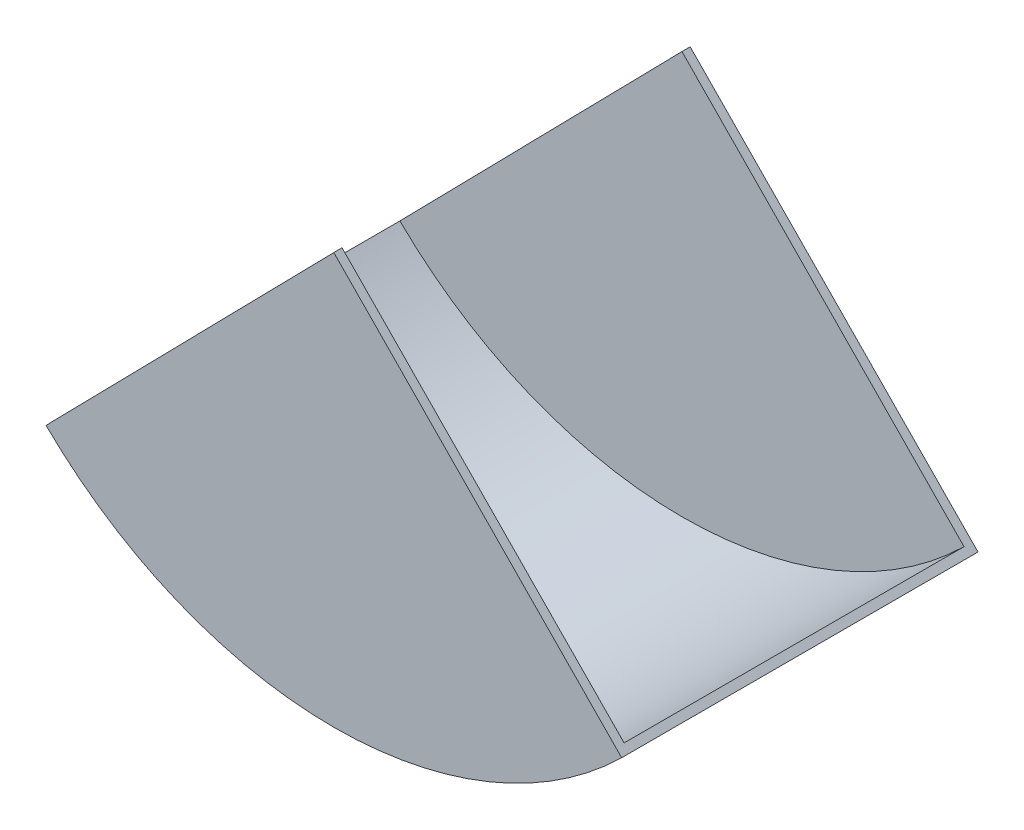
ISO-10303-21;
HEADER;
FILE_DESCRIPTION(('STEP AP214'),'2;1');
FILE_NAME('part.step','',(''),(''),'','','');
FILE_SCHEMA(('AUTOMOTIVE_DESIGN { 1 0 10303 214 1 1 1 1 }'));
ENDSEC;
DATA;
#1=APPLICATION_CONTEXT('core data for automotive mechanical design processes');
#2=APPLICATION_PROTOCOL_DEFINITION('international standard','automotive_design',2000,#1);
#3=PRODUCT_CONTEXT('',#1,'mechanical');
#4=PRODUCT('Part','Part','',(#3));
#5=PRODUCT_RELATED_PRODUCT_CATEGORY('part','',(#4));
#6=PRODUCT_DEFINITION_FORMATION('','',#4);
#7=PRODUCT_DEFINITION_CONTEXT('part definition',#1,'design');
#8=PRODUCT_DEFINITION('design','',#6,#7);
#9=PRODUCT_DEFINITION_SHAPE('','',#8);
#10=(LENGTH_UNIT() NAMED_UNIT(*) SI_UNIT(.MILLI.,.METRE.));
#11=(NAMED_UNIT(*) PLANE_ANGLE_UNIT() SI_UNIT($,.RADIAN.));
#12=(NAMED_UNIT(*) SI_UNIT($,.STERADIAN.) SOLID_ANGLE_UNIT());
#13=UNCERTAINTY_MEASURE_WITH_UNIT(LENGTH_MEASURE(1.E-05),#10,'distance_accuracy_value','');
#14=(GEOMETRIC_REPRESENTATION_CONTEXT(3) GLOBAL_UNCERTAINTY_ASSIGNED_CONTEXT((#13)) GLOBAL_UNIT_ASSIGNED_CONTEXT((#10,
#11,#12)) REPRESENTATION_CONTEXT('',''));
#15=CARTESIAN_POINT('',(0.,0.,0.));
#16=DIRECTION('',(0.,0.,1.));
#17=DIRECTION('',(1.,0.,0.));
#18=AXIS2_PLACEMENT_3D('',#15,#16,#17);
#19=CARTESIAN_POINT('',(0.,0.,65.));
#20=DIRECTION('',(-0.714142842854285,-0.7,0.));
#21=DIRECTION('',(0.700000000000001,-0.714142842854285,0.));
#22=AXIS2_PLACEMENT_3D('',#19,#20,#21);
#23=PLANE('',#22);
#24=DIRECTION('',(-0.700000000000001,0.714142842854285,0.));
#25=VECTOR('',#24,1.);
#26=CARTESIAN_POINT('',(0.,0.,-62.));
#27=LINE('',#26,#25);
#28=CARTESIAN_POINT('',(102.9,-104.97899789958,-62.0000000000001));
#29=VERTEX_POINT('',#28);
#30=CARTESIAN_POINT('',(0.,0.,-62.));
#31=VERTEX_POINT('',#30);
#32=EDGE_CURVE('E134',#29,#31,#27,.T.);
#33=ORIENTED_EDGE('',*,*,#32,.F.);
#34=DIRECTION('',(0.,0.,1.));
#35=VECTOR('',#34,1.);
#36=CARTESIAN_POINT('',(102.9,-104.97899789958,-62.0000000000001));
#37=LINE('',#36,#35);
#38=CARTESIAN_POINT('',(102.9,-104.97899789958,62.));
#39=VERTEX_POINT('',#38);
#40=EDGE_CURVE('E95',#29,#39,#37,.T.);
#41=ORIENTED_EDGE('',*,*,#40,.T.);
#42=DIRECTION('',(-0.700000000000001,0.714142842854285,0.));
#43=VECTOR('',#42,1.);
#44=CARTESIAN_POINT('',(0.,0.,62.));
#45=LINE('',#44,#43);
#46=CARTESIAN_POINT('',(0.,0.,62.));
#47=VERTEX_POINT('',#46);
#48=EDGE_CURVE('E86',#39,#47,#45,.T.);
#49=ORIENTED_EDGE('',*,*,#48,.T.);
#50=DIRECTION('',(0.,0.,-1.));
#51=VECTOR('',#50,1.);
#52=CARTESIAN_POINT('',(0.,0.,65.));
#53=LINE('',#52,#51);
#54=CARTESIAN_POINT('',(0.,0.,65.));
#55=VERTEX_POINT('',#54);
#56=EDGE_CURVE('E11',#55,#47,#53,.T.);
#57=ORIENTED_EDGE('',*,*,#56,.F.);
#58=DIRECTION('',(-0.7,0.714142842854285,0.));
#59=VECTOR('',#58,1.);
#60=CARTESIAN_POINT('',(0.,0.,65.));
#61=LINE('',#60,#59);
#62=CARTESIAN_POINT('',(105.,-107.121426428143,65.));
#63=VERTEX_POINT('',#62);
#64=EDGE_CURVE('E103',#63,#55,#61,.T.);
#65=ORIENTED_EDGE('',*,*,#64,.F.);
#66=DIRECTION('',(0.,0.,-1.));
#67=VECTOR('',#66,1.);
#68=CARTESIAN_POINT('',(105.,-107.121426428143,65.));
#69=LINE('',#68,#67);
#70=CARTESIAN_POINT('',(105.,-107.121426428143,-65.0000000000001));
#71=VERTEX_POINT('',#70);
#72=EDGE_CURVE('E114',#63,#71,#69,.T.);
#73=ORIENTED_EDGE('',*,*,#72,.T.);
#74=DIRECTION('',(-0.7,0.714142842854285,0.));
#75=VECTOR('',#74,1.);
#76=CARTESIAN_POINT('',(0.,0.,-65.));
#77=LINE('',#76,#75);
#78=CARTESIAN_POINT('',(0.,0.,-65.));
#79=VERTEX_POINT('',#78);
#80=EDGE_CURVE('E124',#71,#79,#77,.T.);
#81=ORIENTED_EDGE('',*,*,#80,.T.);
#82=EDGE_CURVE('E39',#31,#79,#53,.T.);
#83=ORIENTED_EDGE('',*,*,#82,.F.);
#84=EDGE_LOOP('',(#33,#41,#49,#57,#65,#73,#81,#83));
#85=FACE_BOUND('',#84,.T.);
#86=ADVANCED_FACE('F32',(#85),#23,.F.);
#87=CARTESIAN_POINT('',(0.,0.,65.));
#88=DIRECTION('',(0.714142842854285,-0.7,0.));
#89=DIRECTION('',(0.7,0.714142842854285,0.));
#90=AXIS2_PLACEMENT_3D('',#87,#88,#89);
#91=PLANE('',#90);
#92=DIRECTION('',(-0.7,-0.714142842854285,0.));
#93=VECTOR('',#92,1.);
#94=CARTESIAN_POINT('',(-102.9,-104.97899789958,-62.));
#95=LINE('',#94,#93);
#96=CARTESIAN_POINT('',(-102.9,-104.97899789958,-62.));
#97=VERTEX_POINT('',#96);
#98=EDGE_CURVE('E119',#31,#97,#95,.T.);
#99=ORIENTED_EDGE('',*,*,#98,.F.);
#100=ORIENTED_EDGE('',*,*,#82,.T.);
#101=DIRECTION('',(-0.7,-0.714142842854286,0.));
#102=VECTOR('',#101,1.);
#103=CARTESIAN_POINT('',(0.,0.,-65.));
#104=LINE('',#103,#102);
#105=CARTESIAN_POINT('',(-105.,-107.121426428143,-65.));
#106=VERTEX_POINT('',#105);
#107=EDGE_CURVE('E109',#79,#106,#104,.T.);
#108=ORIENTED_EDGE('',*,*,#107,.T.);
#109=DIRECTION('',(0.,0.,-1.));
#110=VECTOR('',#109,1.);
#111=CARTESIAN_POINT('',(-105.,-107.121426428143,65.));
#112=LINE('',#111,#110);
#113=CARTESIAN_POINT('',(-105.,-107.121426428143,65.));
#114=VERTEX_POINT('',#113);
#115=EDGE_CURVE('E102',#114,#106,#112,.T.);
#116=ORIENTED_EDGE('',*,*,#115,.F.);
#117=DIRECTION('',(-0.7,-0.714142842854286,0.));
#118=VECTOR('',#117,1.);
#119=CARTESIAN_POINT('',(0.,0.,65.));
#120=LINE('',#119,#118);
#121=EDGE_CURVE('E100',#55,#114,#120,.T.);
#122=ORIENTED_EDGE('',*,*,#121,.F.);
#123=ORIENTED_EDGE('',*,*,#56,.T.);
#124=DIRECTION('',(-0.7,-0.714142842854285,0.));
#125=VECTOR('',#124,1.);
#126=CARTESIAN_POINT('',(-102.9,-104.97899789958,62.));
#127=LINE('',#126,#125);
#128=CARTESIAN_POINT('',(-102.9,-104.97899789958,62.));
#129=VERTEX_POINT('',#128);
#130=EDGE_CURVE('E83',#47,#129,#127,.T.);
#131=ORIENTED_EDGE('',*,*,#130,.T.);
#132=DIRECTION('',(0.,0.,1.));
#133=VECTOR('',#132,1.);
#134=CARTESIAN_POINT('',(-102.9,-104.97899789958,-62.));
#135=LINE('',#134,#133);
#136=EDGE_CURVE('E126',#97,#129,#135,.T.);
#137=ORIENTED_EDGE('',*,*,#136,.F.);
#138=EDGE_LOOP('',(#99,#100,#108,#116,#122,#123,#131,#137));
#139=FACE_BOUND('',#138,.T.);
#140=ADVANCED_FACE('F98',(#139),#91,.F.);
#141=CARTESIAN_POINT('',(0.,0.,65.));
#142=DIRECTION('',(0.,0.,-1.));
#143=DIRECTION('',(-1.,0.,0.));
#144=AXIS2_PLACEMENT_3D('',#141,#142,#143);
#145=CYLINDRICAL_SURFACE('',#144,150.);
#146=CARTESIAN_POINT('',(0.,0.,-65.));
#147=DIRECTION('',(0.,0.,1.));
#148=DIRECTION('',(1.,0.,0.));
#149=AXIS2_PLACEMENT_3D('',#146,#147,#148);
#150=CIRCLE('',#149,150.);
#151=EDGE_CURVE('E107',#106,#71,#150,.T.);
#152=ORIENTED_EDGE('',*,*,#151,.T.);
#153=ORIENTED_EDGE('',*,*,#72,.F.);
#154=CARTESIAN_POINT('',(0.,0.,65.));
#155=DIRECTION('',(0.,0.,1.));
#156=DIRECTION('',(1.,0.,0.));
#157=AXIS2_PLACEMENT_3D('',#154,#155,#156);
#158=CIRCLE('',#157,150.);
#159=EDGE_CURVE('E54',#114,#63,#158,.T.);
#160=ORIENTED_EDGE('',*,*,#159,.F.);
#161=ORIENTED_EDGE('',*,*,#115,.T.);
#162=EDGE_LOOP('',(#152,#153,#160,#161));
#163=FACE_BOUND('',#162,.T.);
#164=ADVANCED_FACE('F153',(#163),#145,.T.);
#165=CARTESIAN_POINT('',(0.,0.,65.));
#166=DIRECTION('',(0.,0.,1.));
#167=DIRECTION('',(1.,0.,0.));
#168=AXIS2_PLACEMENT_3D('',#165,#166,#167);
#169=PLANE('',#168);
#170=ORIENTED_EDGE('',*,*,#64,.T.);
#171=ORIENTED_EDGE('',*,*,#121,.T.);
#172=ORIENTED_EDGE('',*,*,#159,.T.);
#173=EDGE_LOOP('',(#170,#171,#172));
#174=FACE_BOUND('',#173,.T.);
#175=ADVANCED_FACE('F105',(#174),#169,.T.);
#176=CARTESIAN_POINT('',(0.,0.,-65.));
#177=DIRECTION('',(0.,0.,1.));
#178=DIRECTION('',(1.,0.,0.));
#179=AXIS2_PLACEMENT_3D('',#176,#177,#178);
#180=PLANE('',#179);
#181=ORIENTED_EDGE('',*,*,#80,.F.);
#182=ORIENTED_EDGE('',*,*,#151,.F.);
#183=ORIENTED_EDGE('',*,*,#107,.F.);
#184=EDGE_LOOP('',(#181,#182,#183));
#185=FACE_BOUND('',#184,.T.);
#186=ADVANCED_FACE('F123',(#185),#180,.F.);
#187=CARTESIAN_POINT('',(0.,0.,-62.));
#188=DIRECTION('',(0.,0.,1.));
#189=DIRECTION('',(1.,0.,0.));
#190=AXIS2_PLACEMENT_3D('',#187,#188,#189);
#191=CYLINDRICAL_SURFACE('',#190,147.);
#192=CARTESIAN_POINT('',(0.,0.,62.));
#193=DIRECTION('',(0.,0.,1.));
#194=DIRECTION('',(1.,0.,0.));
#195=AXIS2_PLACEMENT_3D('',#192,#193,#194);
#196=CIRCLE('',#195,147.);
#197=EDGE_CURVE('E46',#129,#39,#196,.T.);
#198=ORIENTED_EDGE('',*,*,#197,.T.);
#199=ORIENTED_EDGE('',*,*,#40,.F.);
#200=CARTESIAN_POINT('',(0.,0.,-62.));
#201=DIRECTION('',(0.,0.,1.));
#202=DIRECTION('',(1.,0.,0.));
#203=AXIS2_PLACEMENT_3D('',#200,#201,#202);
#204=CIRCLE('',#203,147.);
#205=EDGE_CURVE('E129',#97,#29,#204,.T.);
#206=ORIENTED_EDGE('',*,*,#205,.F.);
#207=ORIENTED_EDGE('',*,*,#136,.T.);
#208=EDGE_LOOP('',(#198,#199,#206,#207));
#209=FACE_BOUND('',#208,.T.);
#210=ADVANCED_FACE('F137',(#209),#191,.F.);
#211=CARTESIAN_POINT('',(0.,0.,-62.));
#212=DIRECTION('',(0.,0.,1.));
#213=DIRECTION('',(1.,0.,0.));
#214=AXIS2_PLACEMENT_3D('',#211,#212,#213);
#215=PLANE('',#214);
#216=ORIENTED_EDGE('',*,*,#32,.T.);
#217=ORIENTED_EDGE('',*,*,#98,.T.);
#218=ORIENTED_EDGE('',*,*,#205,.T.);
#219=EDGE_LOOP('',(#216,#217,#218));
#220=FACE_BOUND('',#219,.T.);
#221=ADVANCED_FACE('F140',(#220),#215,.T.);
#222=CARTESIAN_POINT('',(0.,0.,62.));
#223=DIRECTION('',(0.,0.,1.));
#224=DIRECTION('',(1.,0.,0.));
#225=AXIS2_PLACEMENT_3D('',#222,#223,#224);
#226=PLANE('',#225);
#227=ORIENTED_EDGE('',*,*,#48,.F.);
#228=ORIENTED_EDGE('',*,*,#197,.F.);
#229=ORIENTED_EDGE('',*,*,#130,.F.);
#230=EDGE_LOOP('',(#227,#228,#229));
#231=FACE_BOUND('',#230,.T.);
#232=ADVANCED_FACE('F85',(#231),#226,.F.);
#233=CLOSED_SHELL('',(#86,#140,#164,#175,#186,#210,#221,#232));
#234=MANIFOLD_SOLID_BREP('B2',#233);
#235=ADVANCED_BREP_SHAPE_REPRESENTATION('',(#18,#234),#14);
#236=SHAPE_DEFINITION_REPRESENTATION(#9,#235);
ENDSEC;
END-ISO-10303-21;
